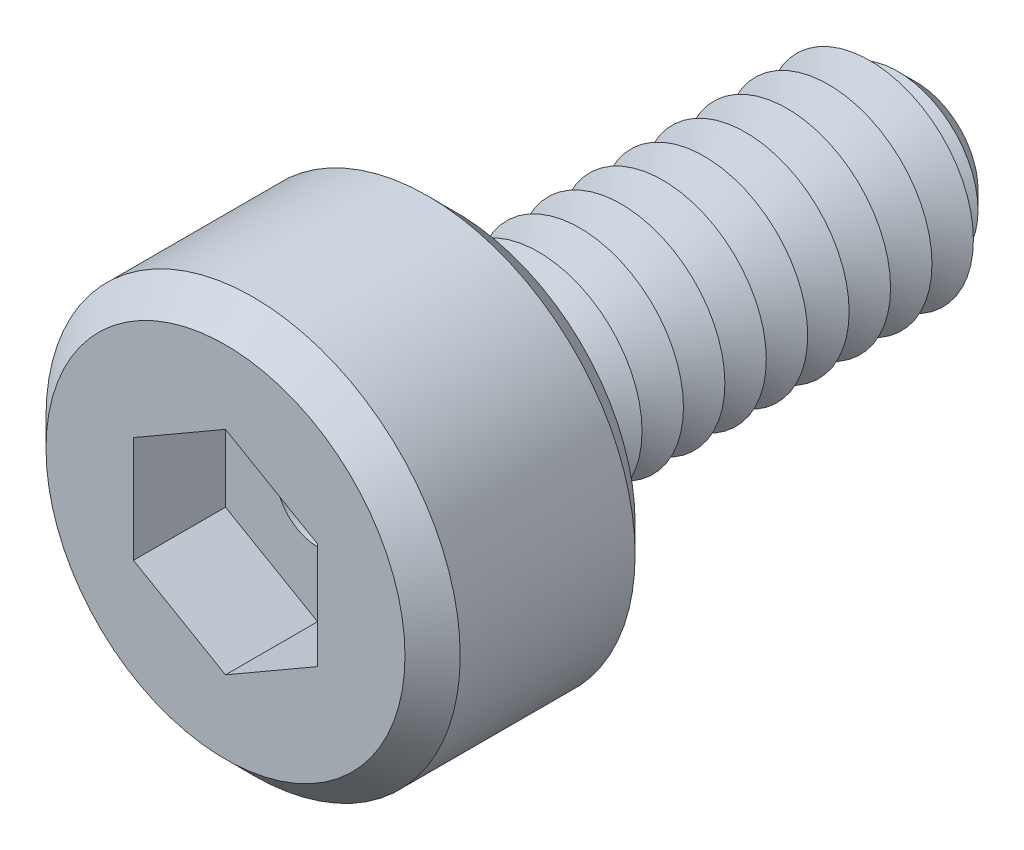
from build123d import *

# Parameters (mm, degrees)
SKETCH1_R           = 2.25
BOSS_EXTRUDE1_DEPTH = 2.5
SKETCH2_R           = 1.125
BOSS_EXTRUDE2_DEPTH = 5
CHAMFER1_SIZE       = 0.45
LPATTERN1_COUNT     = 11
LPATTERN1_PITCH     = 0.45
CUT_EXTRUDE1_DEPTH  = 1
SKETCH6_R           = 0.45
CUT_EXTRUDE2_DEPTH  = 6.5
CHAMFER2_SIZE       = 0.3


with BuildPart() as part:
    # Sketch1 → Boss-Extrude1 (new body)
    with BuildSketch(Plane.XY):
        Circle(SKETCH1_R)
    extrude(amount=BOSS_EXTRUDE1_DEPTH)

    # Sketch2 → Boss-Extrude2 (add)
    with BuildSketch(Plane(origin=(0, 0, 0), x_dir=(-1, 0, 0), z_dir=(0, 0, -1))):
        Circle(SKETCH2_R)
    extrude(amount=BOSS_EXTRUDE2_DEPTH)

    # Chamfer1
    chamfer1_edges = [part.edges().sort_by_distance(p)[0] for p in [
        (1.125, 0, -5),
    ]]
    chamfer(chamfer1_edges, length=CHAMFER1_SIZE)

    # Sketch4 → Cut-Revolve1 (revolve, cut)
    with BuildSketch(Plane(origin=(0, 0, 0), x_dir=(0, 0, -1), z_dir=(1, 0, 0)), mode=Mode.PRIVATE) as cut_revolve1_sk:
        Polygon((0, 1.125), (0.225, 0.735288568), (0.45, 1.125), align=None)
    cut_revolve1 = revolve(cut_revolve1_sk.sketch.rotate(Axis((0, 0, 2.512122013), (0, 0, -1)), 90), axis=Axis((0, 0, 2.512122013), (0, 0, -1)), mode=Mode.SUBTRACT)

    # LPattern1: Cut-Revolve1 ×11
    with Locations(*[(0, 0, -i * LPATTERN1_PITCH) for i in range(1, LPATTERN1_COUNT)]):
        add(cut_revolve1, mode=Mode.SUBTRACT)

    # Sketch5 → Cut-Extrude1 (cut)
    with BuildSketch(Plane.XY.offset(2.5)):
        Polygon((0, 1.154700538), (-1, 0.577350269), (-1, -0.577350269), (0, -1.154700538), (1, -0.577350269), (1, 0.577350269), align=None)
    extrude(amount=-CUT_EXTRUDE1_DEPTH, mode=Mode.SUBTRACT)

    # Sketch6 → Cut-Extrude2 (cut)
    with BuildSketch(Plane.XY.offset(1.5)):
        Circle(SKETCH6_R)
    extrude(amount=-CUT_EXTRUDE2_DEPTH, mode=Mode.SUBTRACT)

    # Chamfer2
    chamfer2_edges = [part.edges().sort_by_distance(p)[0] for p in [
        (-2.25, 0, 0),
        (-2.25, 0, 2.5),
    ]]
    chamfer(chamfer2_edges, length=CHAMFER2_SIZE)


solid = part.part
